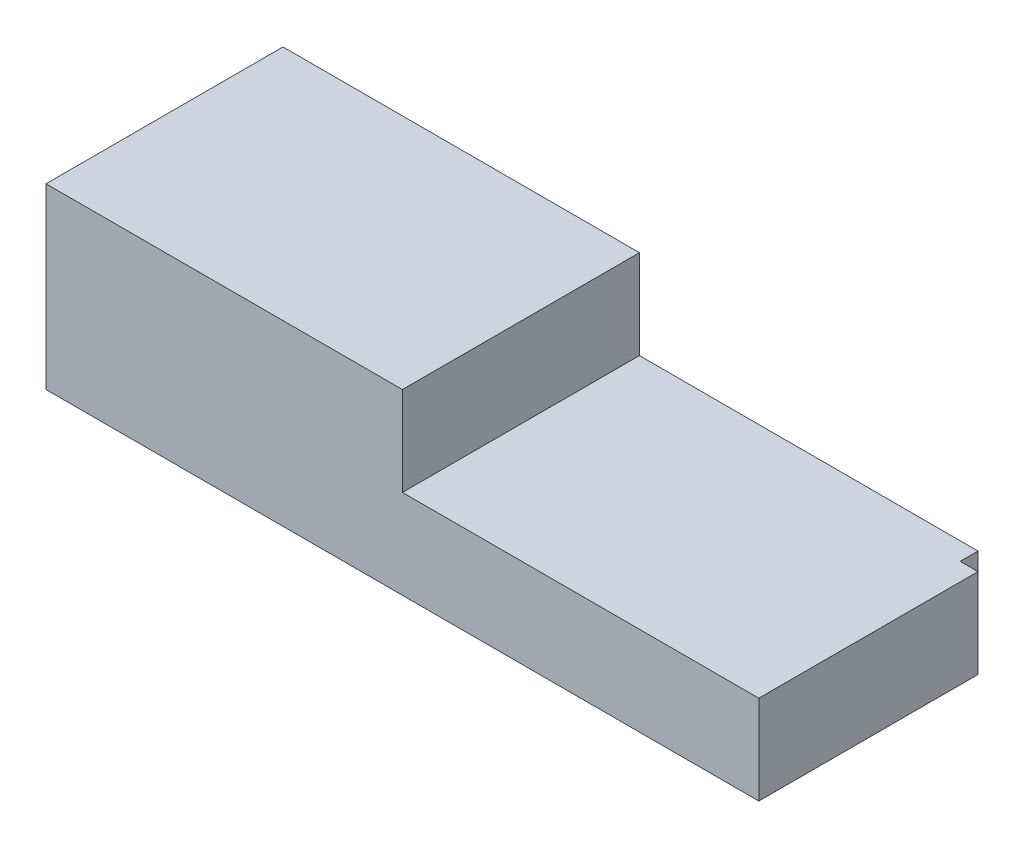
from build123d import *

# Parameters (mm, degrees)
EXTRUDE_1_DEPTH          = 13.3
CUT_EXTRUDE_1_DEPTH      = 44.323088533
CUT_EXTRUDE_1_DEPTH_BACK = 44.323088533
SKETCH_4_R               = 1.65
CUT_EXTRUDE_2_DEPTH      = 5


with BuildPart() as part:
    # Sketch 1 → Extrude 1 (new body)
    with BuildSketch(Plane.XY):
        Polygon((40, 0), (40, 5), (20, 5), (20, 10), (0, 10), (0, 0), align=None)
    extrude(amount=EXTRUDE_1_DEPTH)

    # Sketch 2 → Cut-Extrude 1 (cut, two sides: drawn at the far end of the back side and taken through both)
    with BuildSketch(Plane(origin=(0, 10, 0), x_dir=(1, 0, 0), z_dir=(0, 1, 0)).offset(-CUT_EXTRUDE_1_DEPTH_BACK)):
        Polygon((39, 93.696833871), (39, 0), (39, -1), (40, -1), (133.696833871, -1), (266.204167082, 131.507333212), (171.507333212, 226.204167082), align=None)
    extrude(amount=CUT_EXTRUDE_1_DEPTH + CUT_EXTRUDE_1_DEPTH_BACK, mode=Mode.SUBTRACT)

    # Sketch 4 → Cut-Extrude 2 (cut)
    with BuildSketch(Plane.ZY):
        with Locations((6.1, 5)):
            Circle(SKETCH_4_R)
    extrude(amount=-CUT_EXTRUDE_2_DEPTH, mode=Mode.SUBTRACT)


solid = part.part
